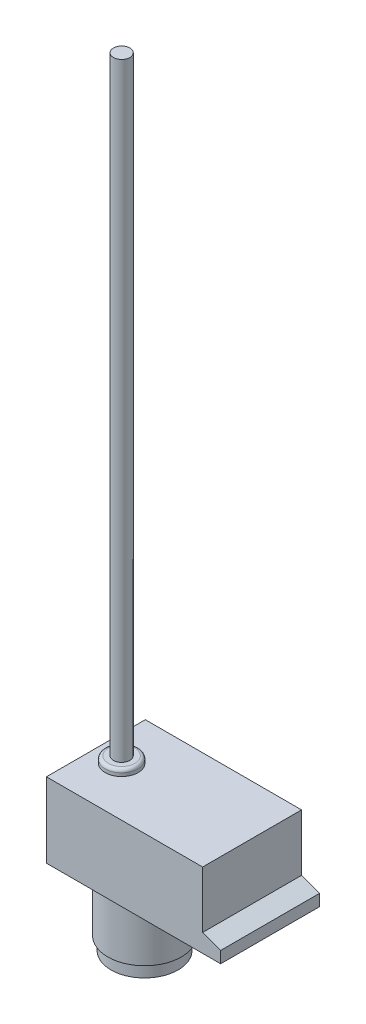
from build123d import *

# Parameters (mm, degrees)
BOSS_EXTRUDE1_DEPTH       = 19.5
SKETCH4_R                 = 6.5
BOSS_EXTRUDE2_DEPTH       = 2.54
FILLET1_R                 = 1.27
SKETCH6_R                 = 3.25
BOSS_EXTRUDE3_DEPTH       = 240
M4X0_7_TAPPED_HOLE1_D     = 3.3
M4X0_7_TAPPED_HOLE1_DEPTH = 5.999988
M4X0_7_TAPPED_HOLE1_TIP   = 0.991420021


with BuildPart() as part:
    # Sketch1 → Boss-Extrude1 (new, symmetric)
    with BuildSketch(Plane.XY):
        Polygon((-34.35, 0), (34.35, 0), (34.35, 4.572), (27.238, 7.148), (27.238, 29.5), (-34.35, 29.5), align=None)
    extrude(amount=BOSS_EXTRUDE1_DEPTH, both=True)

    # Sketch3 → Revolve2 (revolve)
    with BuildSketch(Plane(origin=(-15.15, 0, 0), x_dir=(0, 0, -1), z_dir=(1, 0, 0))):
        Polygon((0, 0), (-14.5, 0), (-14.5, -24.92), (-13.23, -24.92), (-13.23, -30), (0, -30), align=None)
    revolve(axis=Axis((-15.15, 29.5, 0), (0, -1, 0)))

    # Sketch4 → Boss-Extrude2 (add)
    with BuildSketch(Plane(origin=(0, 29.5, 0), x_dir=(1, 0, 0), z_dir=(0, 1, 0))):
        with Locations((-24.19, 0)):
            Circle(SKETCH4_R)
    extrude(amount=BOSS_EXTRUDE2_DEPTH)

    # Fillet1
    fillet1_edges = [part.edges().sort_by_distance(p)[0] for p in [
        (-30.69, 32.04, 0),
    ]]
    fillet(fillet1_edges, radius=FILLET1_R)

    # Sketch6 → Boss-Extrude3 (add)
    with BuildSketch(Plane(origin=(0, 32.04, 0), x_dir=(1, 0, 0), z_dir=(0, 1, 0))):
        with Locations(Location((-24.19, 0, 0), (0, 0, 180))):
            Circle(SKETCH6_R)
    extrude(amount=BOSS_EXTRUDE3_DEPTH)

    # M4x0.7 Tapped Hole1
    with Locations(Plane(origin=(0, 0, 0), x_dir=(-1, 0, 0), z_dir=(0, -1, 0))):
        with Locations((-4.85, -10), (-4.85, 10)):
            Hole(M4X0_7_TAPPED_HOLE1_D / 2, depth=M4X0_7_TAPPED_HOLE1_DEPTH)
            with Locations((0, 0, -(M4X0_7_TAPPED_HOLE1_DEPTH + M4X0_7_TAPPED_HOLE1_TIP / 2))):  # 118° drill point
                Cone(0, M4X0_7_TAPPED_HOLE1_D / 2, M4X0_7_TAPPED_HOLE1_TIP, mode=Mode.SUBTRACT)


solid = part.part
